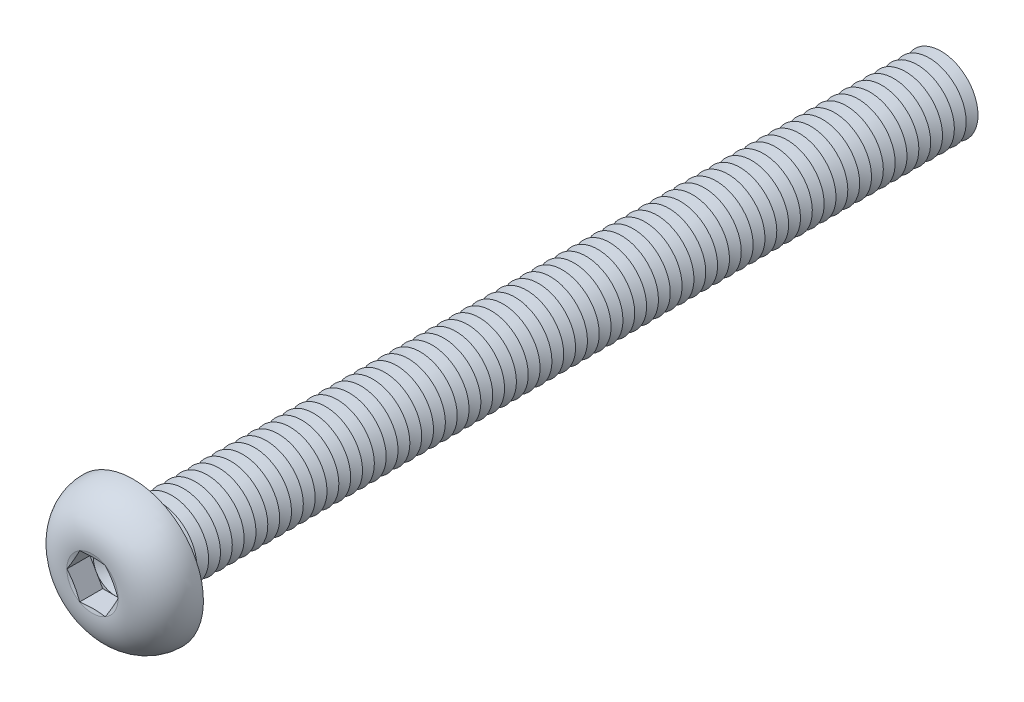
from build123d import *

# Parameters (mm, degrees)
FILLET1_R          = 0.4
LPATTERN1_COUNT    = 68
LPATTERN1_PITCH    = 0.8
CUT_EXTRUDE1_DEPTH = 1.56


with BuildPart() as part:
    # Sketch1 → Revolve1 (revolve)
    with BuildSketch(Plane(origin=(0, 0, 0), x_dir=(0, 0, -1), z_dir=(1, 0, 0))):
        with BuildLine():
            Line((0, 2.5), (0, 4.75))
            ThreePointArc((0, 4.75), (-2.041477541, 3.848329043), (-2.75, 1.73205))
            Line((-2.75, 1.73205), (-2.517949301, 0.866025))
            Line((-2.517949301, 0.866025), (-2.75, 0.866025))
            Line((-2.75, 0.866025), (-2.75, 0))
            Line((-2.75, 0), (55, 0))
            Line((55, 0), (55, 2.5))
            Line((55, 2.5), (0, 2.5))
        make_face()
    revolve(axis=Axis((0, 0, -55), (0, 0, 1)))

    # Fillet1
    fillet1_edges = [part.edges().sort_by_distance(p)[0] for p in [
        (0, -2.5, 0),
    ]]
    fillet(fillet1_edges, radius=FILLET1_R)

    # Sketch2 → Cut-Revolve1 (revolve, cut)
    with BuildSketch(Plane(origin=(0, 0, 0), x_dir=(0, 0, -1), z_dir=(1, 0, 0))):
        Polygon((54.6, 2.5), (55.4, 2.5), (55, 1.807179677), align=None)
    cut_revolve1 = revolve(axis=Axis((0, 0, -55), (0, 0, -1)), mode=Mode.SUBTRACT)

    # LPattern1: Cut-Revolve1 ×68
    with Locations(*[(0, 0, i * LPATTERN1_PITCH) for i in range(1, LPATTERN1_COUNT)]):
        add(cut_revolve1, mode=Mode.SUBTRACT)

    # Sketch3 → Cut-Extrude1 (cut)
    with BuildSketch(Plane.XY.offset(2.75)):
        Polygon((0.866025, 1.499999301), (-0.866025, 1.499999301), (-1.73205, 0), (-0.866025, -1.499999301), (0.866025, -1.499999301), (1.73205, 0), align=None)
    extrude(amount=-CUT_EXTRUDE1_DEPTH, mode=Mode.SUBTRACT)

    # Cut-Extrude2 cone 1 section (on through the dimple's axis) → Cut-Extrude2 (revolve, cut)
    with BuildSketch(Plane(origin=(0, 0, 1.19), x_dir=(0, -1, 0), z_dir=(1, 0, 0))):
        Polygon((0, 0), (1.499999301, 0), (0, 0.866025), align=None)
    revolve(axis=Axis((0, 0, 1.19), (0, 0, -1)), mode=Mode.SUBTRACT)


solid = part.part
